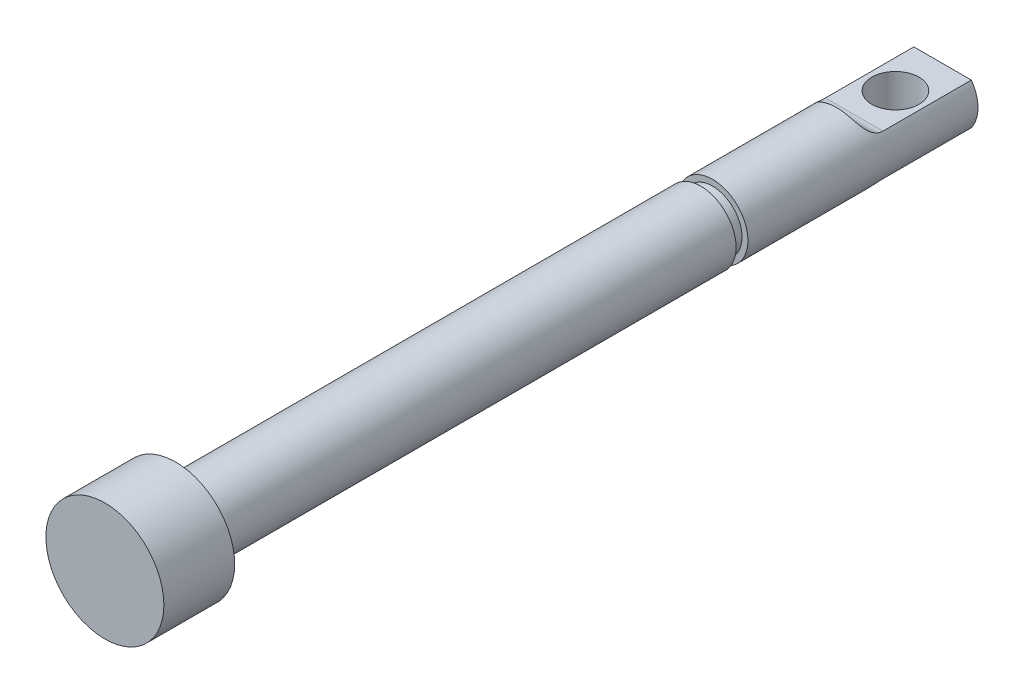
ISO-10303-21;
HEADER;
FILE_DESCRIPTION(('STEP AP214'),'2;1');
FILE_NAME('part.step','',(''),(''),'','','');
FILE_SCHEMA(('AUTOMOTIVE_DESIGN { 1 0 10303 214 1 1 1 1 }'));
ENDSEC;
DATA;
#1=APPLICATION_CONTEXT('core data for automotive mechanical design processes');
#2=APPLICATION_PROTOCOL_DEFINITION('international standard','automotive_design',2000,#1);
#3=PRODUCT_CONTEXT('',#1,'mechanical');
#4=PRODUCT('Part','Part','',(#3));
#5=PRODUCT_RELATED_PRODUCT_CATEGORY('part','',(#4));
#6=PRODUCT_DEFINITION_FORMATION('','',#4);
#7=PRODUCT_DEFINITION_CONTEXT('part definition',#1,'design');
#8=PRODUCT_DEFINITION('design','',#6,#7);
#9=PRODUCT_DEFINITION_SHAPE('','',#8);
#10=(LENGTH_UNIT() NAMED_UNIT(*) SI_UNIT(.MILLI.,.METRE.));
#11=(NAMED_UNIT(*) PLANE_ANGLE_UNIT() SI_UNIT($,.RADIAN.));
#12=(NAMED_UNIT(*) SI_UNIT($,.STERADIAN.) SOLID_ANGLE_UNIT());
#13=UNCERTAINTY_MEASURE_WITH_UNIT(LENGTH_MEASURE(1.E-05),#10,'distance_accuracy_value','');
#14=(GEOMETRIC_REPRESENTATION_CONTEXT(3) GLOBAL_UNCERTAINTY_ASSIGNED_CONTEXT((#13)) GLOBAL_UNIT_ASSIGNED_CONTEXT((#10,
#11,#12)) REPRESENTATION_CONTEXT('',''));
#15=CARTESIAN_POINT('',(0.,0.,0.));
#16=DIRECTION('',(0.,0.,1.));
#17=DIRECTION('',(1.,0.,0.));
#18=AXIS2_PLACEMENT_3D('',#15,#16,#17);
#19=CARTESIAN_POINT('',(0.,0.,65.));
#20=DIRECTION('',(0.,0.,-1.));
#21=DIRECTION('',(-1.,0.,0.));
#22=AXIS2_PLACEMENT_3D('',#19,#20,#21);
#23=CYLINDRICAL_SURFACE('',#22,6.);
#24=CARTESIAN_POINT('',(0.,0.,-23.9999999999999));
#25=DIRECTION('',(0.,0.,1.));
#26=DIRECTION('',(1.,0.,0.));
#27=AXIS2_PLACEMENT_3D('',#24,#25,#26);
#28=CIRCLE('',#27,6.);
#29=CARTESIAN_POINT('',(5.99999999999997,0.,-23.9999999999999));
#30=VERTEX_POINT('',#29);
#31=EDGE_CURVE('E139',#30,#30,#28,.T.);
#32=ORIENTED_EDGE('',*,*,#31,.T.);
#33=EDGE_LOOP('',(#32));
#34=FACE_BOUND('',#33,.T.);
#35=CARTESIAN_POINT('',(0.,0.,65.));
#36=DIRECTION('',(0.,0.,1.));
#37=DIRECTION('',(1.,0.,0.));
#38=AXIS2_PLACEMENT_3D('',#35,#36,#37);
#39=CIRCLE('',#38,6.);
#40=CARTESIAN_POINT('',(6.,0.,65.));
#41=VERTEX_POINT('',#40);
#42=EDGE_CURVE('E121',#41,#41,#39,.T.);
#43=ORIENTED_EDGE('',*,*,#42,.F.);
#44=EDGE_LOOP('',(#43));
#45=FACE_BOUND('',#44,.T.);
#46=ADVANCED_FACE('F40',(#34,#45),#23,.T.);
#47=CARTESIAN_POINT('',(0.,0.,65.));
#48=DIRECTION('',(0.,0.,1.));
#49=DIRECTION('',(1.,0.,0.));
#50=AXIS2_PLACEMENT_3D('',#47,#48,#49);
#51=PLANE('',#50);
#52=CARTESIAN_POINT('',(0.,0.,65.));
#53=DIRECTION('',(0.,0.,1.));
#54=DIRECTION('',(1.,0.,0.));
#55=AXIS2_PLACEMENT_3D('',#52,#53,#54);
#56=CIRCLE('',#55,10.);
#57=CARTESIAN_POINT('',(10.,0.,65.));
#58=VERTEX_POINT('',#57);
#59=EDGE_CURVE('E145',#58,#58,#56,.T.);
#60=ORIENTED_EDGE('',*,*,#59,.F.);
#61=EDGE_LOOP('',(#60));
#62=FACE_BOUND('',#61,.T.);
#63=ORIENTED_EDGE('',*,*,#42,.T.);
#64=EDGE_LOOP('',(#63));
#65=FACE_BOUND('',#64,.T.);
#66=ADVANCED_FACE('F165',(#62,#65),#51,.F.);
#67=CARTESIAN_POINT('',(0.,-2.04003480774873E-12,77.));
#68=DIRECTION('',(0.,0.,-1.));
#69=DIRECTION('',(-1.,0.,0.));
#70=AXIS2_PLACEMENT_3D('',#67,#68,#69);
#71=CYLINDRICAL_SURFACE('',#70,10.);
#72=CARTESIAN_POINT('',(0.,-2.04003480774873E-12,77.));
#73=DIRECTION('',(0.,0.,1.));
#74=DIRECTION('',(1.,0.,0.));
#75=AXIS2_PLACEMENT_3D('',#72,#73,#74);
#76=CIRCLE('',#75,10.);
#77=CARTESIAN_POINT('',(10.,-2.04003480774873E-12,77.));
#78=VERTEX_POINT('',#77);
#79=EDGE_CURVE('E136',#78,#78,#76,.T.);
#80=ORIENTED_EDGE('',*,*,#79,.F.);
#81=EDGE_LOOP('',(#80));
#82=FACE_BOUND('',#81,.T.);
#83=ORIENTED_EDGE('',*,*,#59,.T.);
#84=EDGE_LOOP('',(#83));
#85=FACE_BOUND('',#84,.T.);
#86=ADVANCED_FACE('F163',(#82,#85),#71,.T.);
#87=CARTESIAN_POINT('',(0.,-2.04003480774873E-12,77.));
#88=DIRECTION('',(0.,0.,1.));
#89=DIRECTION('',(1.,0.,0.));
#90=AXIS2_PLACEMENT_3D('',#87,#88,#89);
#91=PLANE('',#90);
#92=ORIENTED_EDGE('',*,*,#79,.T.);
#93=EDGE_LOOP('',(#92));
#94=FACE_BOUND('',#93,.T.);
#95=ADVANCED_FACE('F161',(#94),#91,.T.);
#96=CARTESIAN_POINT('',(0.,8.2981060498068,-26.));
#97=DIRECTION('',(0.,0.,-1.));
#98=DIRECTION('',(-1.,0.,0.));
#99=AXIS2_PLACEMENT_3D('',#96,#97,#98);
#100=PLANE('',#99);
#101=CARTESIAN_POINT('',(0.,0.,-26.));
#102=DIRECTION('',(0.,0.,-1.));
#103=DIRECTION('',(-1.,0.,0.));
#104=AXIS2_PLACEMENT_3D('',#101,#102,#103);
#105=CIRCLE('',#104,5.);
#106=CARTESIAN_POINT('',(-5.,0.,-26.));
#107=VERTEX_POINT('',#106);
#108=EDGE_CURVE('E141',#107,#107,#105,.T.);
#109=ORIENTED_EDGE('',*,*,#108,.T.);
#110=EDGE_LOOP('',(#109));
#111=FACE_BOUND('',#110,.T.);
#112=CARTESIAN_POINT('',(0.,0.,-26.));
#113=DIRECTION('',(0.,0.,-1.));
#114=DIRECTION('',(-1.,0.,0.));
#115=AXIS2_PLACEMENT_3D('',#112,#113,#114);
#116=CIRCLE('',#115,6.);
#117=CARTESIAN_POINT('',(-6.,0.,-26.));
#118=VERTEX_POINT('',#117);
#119=EDGE_CURVE('E122',#118,#118,#116,.T.);
#120=ORIENTED_EDGE('',*,*,#119,.F.);
#121=EDGE_LOOP('',(#120));
#122=FACE_BOUND('',#121,.T.);
#123=ADVANCED_FACE('F171',(#111,#122),#100,.F.);
#124=CARTESIAN_POINT('',(0.,8.2981060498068,-24.));
#125=DIRECTION('',(0.,0.,1.));
#126=DIRECTION('',(1.,0.,0.));
#127=AXIS2_PLACEMENT_3D('',#124,#125,#126);
#128=PLANE('',#127);
#129=CARTESIAN_POINT('',(0.,0.,-23.9999999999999));
#130=DIRECTION('',(0.,0.,-1.));
#131=DIRECTION('',(-1.,0.,0.));
#132=AXIS2_PLACEMENT_3D('',#129,#130,#131);
#133=CIRCLE('',#132,5.);
#134=CARTESIAN_POINT('',(-5.00000000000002,0.,-23.9999999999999));
#135=VERTEX_POINT('',#134);
#136=EDGE_CURVE('E147',#135,#135,#133,.T.);
#137=ORIENTED_EDGE('',*,*,#136,.F.);
#138=EDGE_LOOP('',(#137));
#139=FACE_BOUND('',#138,.T.);
#140=ORIENTED_EDGE('',*,*,#31,.F.);
#141=EDGE_LOOP('',(#140));
#142=FACE_BOUND('',#141,.T.);
#143=ADVANCED_FACE('F111',(#139,#142),#128,.F.);
#144=CARTESIAN_POINT('',(0.,-2.04003480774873E-12,-45.4208729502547));
#145=DIRECTION('',(0.,0.,-1.));
#146=DIRECTION('',(-1.,0.,0.));
#147=AXIS2_PLACEMENT_3D('',#144,#145,#146);
#148=CYLINDRICAL_SURFACE('',#147,5.);
#149=ORIENTED_EDGE('',*,*,#108,.F.);
#150=EDGE_LOOP('',(#149));
#151=FACE_BOUND('',#150,.T.);
#152=ORIENTED_EDGE('',*,*,#136,.T.);
#153=EDGE_LOOP('',(#152));
#154=FACE_BOUND('',#153,.T.);
#155=ADVANCED_FACE('F193',(#151,#154),#148,.T.);
#156=CARTESIAN_POINT('',(0.,-6.00000000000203,-56.9999999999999));
#157=DIRECTION('',(0.,1.,0.));
#158=DIRECTION('',(0.,0.,1.));
#159=AXIS2_PLACEMENT_3D('',#156,#157,#158);
#160=CYLINDRICAL_SURFACE('',#159,4.00000000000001);
#161=CARTESIAN_POINT('',(0.,-3.50000000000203,-56.9999999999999));
#162=DIRECTION('',(0.,1.,0.));
#163=DIRECTION('',(0.,0.,1.));
#164=AXIS2_PLACEMENT_3D('',#161,#162,#163);
#165=CIRCLE('',#164,4.00000000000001);
#166=CARTESIAN_POINT('',(0.,-3.50000000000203,-52.9999999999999));
#167=VERTEX_POINT('',#166);
#168=EDGE_CURVE('E209',#167,#167,#165,.F.);
#169=CARTESIAN_POINT('',(0.,3.49999999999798,-56.9999999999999));
#170=DIRECTION('',(0.,-1.,0.));
#171=DIRECTION('',(0.,0.,-1.));
#172=AXIS2_PLACEMENT_3D('',#169,#170,#171);
#173=CIRCLE('',#172,4.00000000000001);
#174=CARTESIAN_POINT('',(0.,3.49999999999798,-52.9999999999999));
#175=VERTEX_POINT('',#174);
#176=EDGE_CURVE('E152',#175,#175,#173,.F.);
#177=CARTESIAN_POINT('',(0.,-3.50000000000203,-52.9999999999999));
#178=CARTESIAN_POINT('',(0.,-3.42708333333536,-52.9999999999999));
#179=CARTESIAN_POINT('',(0.,-3.3541666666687,-52.9999999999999));
#180=CARTESIAN_POINT('',(0.,-3.20833333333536,-52.9999999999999));
#181=CARTESIAN_POINT('',(0.,-3.1354166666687,-52.9999999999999));
#182=CARTESIAN_POINT('',(0.,-2.98958333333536,-52.9999999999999));
#183=CARTESIAN_POINT('',(0.,-2.9166666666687,-52.9999999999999));
#184=CARTESIAN_POINT('',(0.,-2.77083333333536,-52.9999999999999));
#185=CARTESIAN_POINT('',(0.,-2.6979166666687,-52.9999999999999));
#186=CARTESIAN_POINT('',(0.,-2.55208333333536,-52.9999999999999));
#187=CARTESIAN_POINT('',(0.,-2.4791666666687,-52.9999999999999));
#188=CARTESIAN_POINT('',(0.,-2.33333333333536,-52.9999999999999));
#189=CARTESIAN_POINT('',(0.,-2.2604166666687,-52.9999999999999));
#190=CARTESIAN_POINT('',(0.,-2.11458333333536,-52.9999999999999));
#191=CARTESIAN_POINT('',(0.,-2.0416666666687,-52.9999999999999));
#192=CARTESIAN_POINT('',(0.,-1.89583333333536,-52.9999999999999));
#193=CARTESIAN_POINT('',(0.,-1.8229166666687,-52.9999999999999));
#194=CARTESIAN_POINT('',(0.,-1.67708333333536,-52.9999999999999));
#195=CARTESIAN_POINT('',(0.,-1.6041666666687,-52.9999999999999));
#196=CARTESIAN_POINT('',(0.,-1.45833333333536,-52.9999999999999));
#197=CARTESIAN_POINT('',(0.,-1.38541666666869,-52.9999999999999));
#198=CARTESIAN_POINT('',(0.,-1.23958333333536,-52.9999999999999));
#199=CARTESIAN_POINT('',(0.,-1.16666666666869,-52.9999999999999));
#200=CARTESIAN_POINT('',(0.,-1.02083333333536,-52.9999999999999));
#201=CARTESIAN_POINT('',(0.,-0.947916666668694,-52.9999999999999));
#202=CARTESIAN_POINT('',(0.,-0.802083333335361,-52.9999999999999));
#203=CARTESIAN_POINT('',(0.,-0.729166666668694,-52.9999999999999));
#204=CARTESIAN_POINT('',(0.,-0.583333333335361,-52.9999999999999));
#205=CARTESIAN_POINT('',(0.,-0.510416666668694,-52.9999999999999));
#206=CARTESIAN_POINT('',(0.,-0.364583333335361,-52.9999999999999));
#207=CARTESIAN_POINT('',(0.,-0.291666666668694,-52.9999999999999));
#208=CARTESIAN_POINT('',(0.,-0.14583333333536,-52.9999999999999));
#209=CARTESIAN_POINT('',(0.,-0.0729166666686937,-52.9999999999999));
#210=CARTESIAN_POINT('',(0.,0.0729166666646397,-52.9999999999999));
#211=CARTESIAN_POINT('',(0.,0.145833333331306,-52.9999999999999));
#212=CARTESIAN_POINT('',(0.,0.29166666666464,-52.9999999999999));
#213=CARTESIAN_POINT('',(0.,0.364583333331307,-52.9999999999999));
#214=CARTESIAN_POINT('',(0.,0.51041666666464,-52.9999999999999));
#215=CARTESIAN_POINT('',(0.,0.583333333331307,-52.9999999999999));
#216=CARTESIAN_POINT('',(0.,0.72916666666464,-52.9999999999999));
#217=CARTESIAN_POINT('',(0.,0.802083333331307,-52.9999999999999));
#218=CARTESIAN_POINT('',(0.,0.94791666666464,-52.9999999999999));
#219=CARTESIAN_POINT('',(0.,1.02083333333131,-52.9999999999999));
#220=CARTESIAN_POINT('',(0.,1.16666666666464,-52.9999999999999));
#221=CARTESIAN_POINT('',(0.,1.23958333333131,-52.9999999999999));
#222=CARTESIAN_POINT('',(0.,1.38541666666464,-52.9999999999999));
#223=CARTESIAN_POINT('',(0.,1.45833333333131,-52.9999999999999));
#224=CARTESIAN_POINT('',(0.,1.60416666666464,-52.9999999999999));
#225=CARTESIAN_POINT('',(0.,1.67708333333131,-52.9999999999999));
#226=CARTESIAN_POINT('',(0.,1.82291666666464,-52.9999999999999));
#227=CARTESIAN_POINT('',(0.,1.89583333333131,-52.9999999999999));
#228=CARTESIAN_POINT('',(0.,2.04166666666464,-52.9999999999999));
#229=CARTESIAN_POINT('',(0.,2.11458333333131,-52.9999999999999));
#230=CARTESIAN_POINT('',(0.,2.26041666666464,-52.9999999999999));
#231=CARTESIAN_POINT('',(0.,2.33333333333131,-52.9999999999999));
#232=CARTESIAN_POINT('',(0.,2.47916666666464,-52.9999999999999));
#233=CARTESIAN_POINT('',(0.,2.55208333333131,-52.9999999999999));
#234=CARTESIAN_POINT('',(0.,2.69791666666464,-52.9999999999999));
#235=CARTESIAN_POINT('',(0.,2.77083333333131,-52.9999999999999));
#236=CARTESIAN_POINT('',(0.,2.91666666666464,-52.9999999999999));
#237=CARTESIAN_POINT('',(0.,2.98958333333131,-52.9999999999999));
#238=CARTESIAN_POINT('',(0.,3.13541666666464,-52.9999999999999));
#239=CARTESIAN_POINT('',(0.,3.20833333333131,-52.9999999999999));
#240=CARTESIAN_POINT('',(0.,3.35416666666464,-52.9999999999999));
#241=CARTESIAN_POINT('',(0.,3.42708333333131,-52.9999999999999));
#242=CARTESIAN_POINT('',(0.,3.49999999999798,-52.9999999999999));
#243=B_SPLINE_CURVE_WITH_KNOTS('',3,(#177,#178,#179,#180,#181,#182,#183,#184,#185,#186,#187,
#188,#189,#190,#191,#192,#193,#194,#195,#196,#197,#198,#199,#200,#201,#202,#203,#204,#205,#206,
#207,#208,#209,#210,#211,#212,#213,#214,#215,#216,#217,#218,#219,#220,#221,#222,#223,#224,#225,
#226,#227,#228,#229,#230,#231,#232,#233,#234,#235,#236,#237,#238,#239,#240,#241,#242),
.UNSPECIFIED.,.F.,.F.,(4,2,2,2,2,2,2,2,2,2,2,2,2,2,2,2,2,2,2,2,2,2,2,2,2,2,2,2,2,2,2,2,4),(0.,
0.21875,0.4375,0.656250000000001,0.875000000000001,1.09375,1.3125,1.53125,1.75,1.96875,2.1875,
2.40625,2.625,2.84375,3.0625,3.28125,3.5,3.71875,3.9375,4.15625,4.375,4.59375,4.8125,5.03125,
5.25,5.46875,5.6875,5.90625,6.125,6.34375,6.56250000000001,6.78125000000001,7.00000000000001),.UNSPECIFIED.);
#244=EDGE_CURVE('BSEAM186',#167,#175,#243,.T.);
#245=ORIENTED_EDGE('',*,*,#168,.T.);
#246=ORIENTED_EDGE('',*,*,#176,.T.);
#247=ORIENTED_EDGE('',*,*,#244,.T.);
#248=ORIENTED_EDGE('',*,*,#244,.F.);
#249=EDGE_LOOP('',(#245,#247,#246,#248));
#250=FACE_BOUND('',#249,.T.);
#251=ADVANCED_FACE('F186',(#250),#160,.F.);
#252=CARTESIAN_POINT('',(0.,-2.04003480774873E-12,-65.));
#253=DIRECTION('',(0.,0.,1.));
#254=DIRECTION('',(1.,0.,0.));
#255=AXIS2_PLACEMENT_3D('',#252,#253,#254);
#256=PLANE('',#255);
#257=CARTESIAN_POINT('',(0.,-2.04003480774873E-12,-65.));
#258=DIRECTION('',(0.,0.,1.));
#259=DIRECTION('',(1.,0.,0.));
#260=AXIS2_PLACEMENT_3D('',#257,#258,#259);
#261=CIRCLE('',#260,6.);
#262=CARTESIAN_POINT('',(4.87339717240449,-3.50000000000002,-65.));
#263=VERTEX_POINT('',#262);
#264=CARTESIAN_POINT('',(4.87339717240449,3.49999999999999,-65.));
#265=VERTEX_POINT('',#264);
#266=EDGE_CURVE('E132',#263,#265,#261,.T.);
#267=ORIENTED_EDGE('',*,*,#266,.F.);
#268=DIRECTION('',(-1.,0.,0.));
#269=VECTOR('',#268,1.);
#270=CARTESIAN_POINT('',(0.,-3.50000000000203,-65.));
#271=LINE('',#270,#269);
#272=CARTESIAN_POINT('',(-4.87339717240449,-3.50000000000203,-65.0000000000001));
#273=VERTEX_POINT('',#272);
#274=EDGE_CURVE('E81',#263,#273,#271,.T.);
#275=ORIENTED_EDGE('',*,*,#274,.T.);
#276=CARTESIAN_POINT('',(-4.87339717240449,3.49999999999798,-65.0000000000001));
#277=VERTEX_POINT('',#276);
#278=EDGE_CURVE('E127',#277,#273,#261,.T.);
#279=ORIENTED_EDGE('',*,*,#278,.F.);
#280=DIRECTION('',(1.,0.,0.));
#281=VECTOR('',#280,1.);
#282=CARTESIAN_POINT('',(0.,3.49999999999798,-65.));
#283=LINE('',#282,#281);
#284=EDGE_CURVE('E131',#277,#265,#283,.T.);
#285=ORIENTED_EDGE('',*,*,#284,.T.);
#286=EDGE_LOOP('',(#267,#275,#279,#285));
#287=FACE_BOUND('',#286,.T.);
#288=ADVANCED_FACE('F130',(#287),#256,.F.);
#289=ORIENTED_EDGE('',*,*,#119,.T.);
#290=EDGE_LOOP('',(#289));
#291=FACE_BOUND('',#290,.T.);
#292=CARTESIAN_POINT('',(0.,-6.00000000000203,-47.0419601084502));
#293=CARTESIAN_POINT('',(0.164086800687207,-5.99999907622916,-47.0419572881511));
#294=CARTESIAN_POINT('',(0.328220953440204,-5.99326231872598,-47.0430745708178));
#295=CARTESIAN_POINT('',(0.655431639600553,-5.96635421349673,-47.0478136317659));
#296=CARTESIAN_POINT('',(0.8185074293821,-5.9461742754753,-47.0514370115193));
#297=CARTESIAN_POINT('',(1.14271710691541,-5.89247422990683,-47.0620306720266));
#298=CARTESIAN_POINT('',(1.30384593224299,-5.8589248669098,-47.069008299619));
#299=CARTESIAN_POINT('',(1.62250892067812,-5.77879171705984,-47.087689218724));
#300=CARTESIAN_POINT('',(1.78004448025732,-5.73221309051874,-47.0993906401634));
#301=CARTESIAN_POINT('',(2.05460033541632,-5.63866666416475,-47.1259983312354));
#302=CARTESIAN_POINT('',(2.17262271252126,-5.59424062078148,-47.139553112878));
#303=CARTESIAN_POINT('',(2.40504716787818,-5.49832168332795,-47.1717140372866));
#304=CARTESIAN_POINT('',(2.51944999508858,-5.44683026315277,-47.190319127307));
#305=CARTESIAN_POINT('',(2.74362615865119,-5.33741887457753,-47.2337999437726));
#306=CARTESIAN_POINT('',(2.85340849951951,-5.2795122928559,-47.2586627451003));
#307=CARTESIAN_POINT('',(3.06766075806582,-5.15796531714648,-47.316074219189));
#308=CARTESIAN_POINT('',(3.17213247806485,-5.09432688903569,-47.3486202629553));
#309=CARTESIAN_POINT('',(3.34743824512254,-4.98020773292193,-47.4128617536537));
#310=CARTESIAN_POINT('',(3.41975480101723,-4.93079844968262,-47.4424262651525));
#311=CARTESIAN_POINT('',(3.56054572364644,-4.83011362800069,-47.5069985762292));
#312=CARTESIAN_POINT('',(3.6290211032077,-4.77883858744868,-47.542004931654));
#313=CARTESIAN_POINT('',(3.76162234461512,-4.67517587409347,-47.6179551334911));
#314=CARTESIAN_POINT('',(3.82575173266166,-4.62278914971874,-47.6588940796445));
#315=CARTESIAN_POINT('',(3.94922469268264,-4.51776562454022,-47.7471226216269));
#316=CARTESIAN_POINT('',(4.00856904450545,-4.46512886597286,-47.7944111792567));
#317=CARTESIAN_POINT('',(4.15998999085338,-4.32561848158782,-47.9295478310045));
#318=CARTESIAN_POINT('',(4.24744810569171,-4.23936454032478,-48.0233870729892));
#319=CARTESIAN_POINT('',(4.40595587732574,-4.07439510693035,-48.2297273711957));
#320=CARTESIAN_POINT('',(4.47701025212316,-3.99567745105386,-48.3422230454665));
#321=CARTESIAN_POINT('',(4.60202217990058,-3.85105248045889,-48.5846990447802));
#322=CARTESIAN_POINT('',(4.65589850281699,-3.78520658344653,-48.7147584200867));
#323=CARTESIAN_POINT('',(4.74583258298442,-3.67183388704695,-48.9883742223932));
#324=CARTESIAN_POINT('',(4.78189220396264,-3.62430517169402,-49.1319292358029));
#325=CARTESIAN_POINT('',(4.83410438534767,-3.55431760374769,-49.4148899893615));
#326=CARTESIAN_POINT('',(4.8517059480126,-3.53004971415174,-49.553585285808));
#327=CARTESIAN_POINT('',(4.87251123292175,-3.50128019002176,-49.8340608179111));
#328=CARTESIAN_POINT('',(4.87571834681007,-3.49677389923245,-49.9758403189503));
#329=CARTESIAN_POINT('',(4.86790760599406,-3.50763570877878,-50.2541843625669));
#330=CARTESIAN_POINT('',(4.85729106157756,-3.52244313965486,-50.3907826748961));
#331=CARTESIAN_POINT('',(4.82236829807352,-3.57010187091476,-50.6589675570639));
#332=CARTESIAN_POINT('',(4.79806394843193,-3.6029507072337,-50.7905548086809));
#333=CARTESIAN_POINT('',(4.73546689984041,-3.68483287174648,-51.0453601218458));
#334=CARTESIAN_POINT('',(4.69714708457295,-3.73389755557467,-51.1685614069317));
#335=CARTESIAN_POINT('',(4.60644904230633,-3.84522502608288,-51.4032255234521));
#336=CARTESIAN_POINT('',(4.55407078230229,-3.90748784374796,-51.5146883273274));
#337=CARTESIAN_POINT('',(4.43364592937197,-4.04367278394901,-51.7271071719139));
#338=CARTESIAN_POINT('',(4.36514332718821,-4.11790937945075,-51.8276009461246));
#339=CARTESIAN_POINT('',(4.21439546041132,-4.27205571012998,-52.0126566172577));
#340=CARTESIAN_POINT('',(4.13214530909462,-4.35196745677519,-52.0972128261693));
#341=CARTESIAN_POINT('',(3.98430865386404,-4.48684830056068,-52.2255000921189));
#342=CARTESIAN_POINT('',(3.92204340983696,-4.54144689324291,-52.2735490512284));
#343=CARTESIAN_POINT('',(3.79244962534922,-4.65021221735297,-52.3628870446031));
#344=CARTESIAN_POINT('',(3.72511967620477,-4.70437882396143,-52.4041741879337));
#345=CARTESIAN_POINT('',(3.58584746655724,-4.81138491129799,-52.4805057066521));
#346=CARTESIAN_POINT('',(3.51389841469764,-4.86422227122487,-52.5155405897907));
#347=CARTESIAN_POINT('',(3.36598404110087,-4.96772653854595,-52.5798938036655));
#348=CARTESIAN_POINT('',(3.29001762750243,-5.01839284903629,-52.6092105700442));
#349=CARTESIAN_POINT('',(3.10628277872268,-5.1348555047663,-52.6724960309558));
#350=CARTESIAN_POINT('',(2.99699695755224,-5.19945229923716,-52.7042784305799));
#351=CARTESIAN_POINT('',(2.77298874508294,-5.32229969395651,-52.7599952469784));
#352=CARTESIAN_POINT('',(2.65826432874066,-5.38054790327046,-52.7839267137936));
#353=CARTESIAN_POINT('',(2.42426297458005,-5.48995881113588,-52.8254634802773));
#354=CARTESIAN_POINT('',(2.30498188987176,-5.54111484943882,-52.8430628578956));
#355=CARTESIAN_POINT('',(2.0628234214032,-5.6357486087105,-52.8732447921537));
#356=CARTESIAN_POINT('',(1.93994633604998,-5.67922696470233,-52.88582776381));
#357=CARTESIAN_POINT('',(1.68739143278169,-5.75941096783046,-52.9074571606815));
#358=CARTESIAN_POINT('',(1.55762141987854,-5.79585910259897,-52.9163792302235));
#359=CARTESIAN_POINT('',(1.29576034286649,-5.85996401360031,-52.93111497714));
#360=CARTESIAN_POINT('',(1.16366924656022,-5.8876206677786,-52.93692861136));
#361=CARTESIAN_POINT('',(0.897864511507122,-5.93397307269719,-52.9462132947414));
#362=CARTESIAN_POINT('',(0.764151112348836,-5.95267013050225,-52.9496846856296));
#363=CARTESIAN_POINT('',(0.495730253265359,-5.98100905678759,-52.9548017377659));
#364=CARTESIAN_POINT('',(0.361022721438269,-5.99065026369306,-52.9564472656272));
#365=CARTESIAN_POINT('',(0.0637739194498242,-6.00185992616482,-52.9583620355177));
#366=CARTESIAN_POINT('',(-0.0988506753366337,-6.0013852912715,-52.9582828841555));
#367=CARTESIAN_POINT('',(-0.423531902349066,-5.9872391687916,-52.9558628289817));
#368=CARTESIAN_POINT('',(-0.58558842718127,-5.973565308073,-52.9535215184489));
#369=CARTESIAN_POINT('',(-0.908093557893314,-5.9331098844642,-52.9460243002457));
#370=CARTESIAN_POINT('',(-1.06854114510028,-5.90632049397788,-52.940866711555));
#371=CARTESIAN_POINT('',(-1.38655156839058,-5.83984993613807,-52.9266635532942));
#372=CARTESIAN_POINT('',(-1.54411502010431,-5.80017155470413,-52.9176188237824));
#373=CARTESIAN_POINT('',(-1.8271270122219,-5.71658040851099,-52.8961623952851));
#374=CARTESIAN_POINT('',(-1.95325138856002,-5.67471525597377,-52.8846497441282));
#375=CARTESIAN_POINT('',(-2.20199777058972,-5.58290014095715,-52.8567870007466));
#376=CARTESIAN_POINT('',(-2.32461973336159,-5.53295007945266,-52.8404368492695));
#377=CARTESIAN_POINT('',(-2.56529700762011,-5.42554955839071,-52.8015731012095));
#378=CARTESIAN_POINT('',(-2.68335946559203,-5.3681115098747,-52.7790696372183));
#379=CARTESIAN_POINT('',(-2.91412104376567,-5.24641683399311,-52.7263390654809));
#380=CARTESIAN_POINT('',(-3.02682210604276,-5.18216270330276,-52.6961147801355));
#381=CARTESIAN_POINT('',(-3.2146774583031,-5.06698349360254,-52.6361706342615));
#382=CARTESIAN_POINT('',(-3.29141687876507,-5.01744505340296,-52.6087378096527));
#383=CARTESIAN_POINT('',(-3.44108580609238,-4.91600387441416,-52.5484188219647));
#384=CARTESIAN_POINT('',(-3.51401629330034,-4.8641017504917,-52.5155340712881));
#385=CARTESIAN_POINT('',(-3.65550875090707,-4.75867906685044,-52.4437391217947));
#386=CARTESIAN_POINT('',(-3.72407512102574,-4.70516021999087,-52.4048351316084));
#387=CARTESIAN_POINT('',(-3.85637558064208,-4.59735380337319,-52.320479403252));
#388=CARTESIAN_POINT('',(-3.92011052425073,-4.54306637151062,-52.2750288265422));
#389=CARTESIAN_POINT('',(-4.08185025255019,-4.39960407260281,-52.1454120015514));
#390=CARTESIAN_POINT('',(-4.17532337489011,-4.31060001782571,-52.0552328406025));
#391=CARTESIAN_POINT('',(-4.34570993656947,-4.13877814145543,-51.8552455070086));
#392=CARTESIAN_POINT('',(-4.42262845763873,-4.05595842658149,-51.7454433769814));
#393=CARTESIAN_POINT('',(-4.52474385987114,-3.94073268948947,-51.5669219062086));
#394=CARTESIAN_POINT('',(-4.55665465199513,-3.90371818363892,-51.5048849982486));
#395=CARTESIAN_POINT('',(-4.61588700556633,-3.83349575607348,-51.3766220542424));
#396=CARTESIAN_POINT('',(-4.64321054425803,-3.80028619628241,-51.3103978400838));
#397=CARTESIAN_POINT('',(-4.69324042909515,-3.73832662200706,-51.1742047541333));
#398=CARTESIAN_POINT('',(-4.71594604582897,-3.70957731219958,-51.1042352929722));
#399=CARTESIAN_POINT('',(-4.7567419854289,-3.65711675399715,-50.9611615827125));
#400=CARTESIAN_POINT('',(-4.77483272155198,-3.63340505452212,-50.8880576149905));
#401=CARTESIAN_POINT('',(-4.81916134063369,-3.57463010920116,-50.6794078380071));
#402=CARTESIAN_POINT('',(-4.84025437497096,-3.54576913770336,-50.5409170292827));
#403=CARTESIAN_POINT('',(-4.86775935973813,-3.50791566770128,-50.2599172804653));
#404=CARTESIAN_POINT('',(-4.87417502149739,-3.498918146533,-50.1174093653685));
#405=CARTESIAN_POINT('',(-4.87249942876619,-3.50124883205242,-49.8375566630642));
#406=CARTESIAN_POINT('',(-4.86490005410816,-3.51188787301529,-49.7002030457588));
#407=CARTESIAN_POINT('',(-4.83602687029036,-3.55154025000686,-49.4296737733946));
#408=CARTESIAN_POINT('',(-4.814755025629,-3.58055094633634,-49.296497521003));
#409=CARTESIAN_POINT('',(-4.75831398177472,-3.65521783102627,-49.0380780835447));
#410=CARTESIAN_POINT('',(-4.72315159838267,-3.7008658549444,-48.9128310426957));
#411=CARTESIAN_POINT('',(-4.63879646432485,-3.80605951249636,-48.6734309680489));
#412=CARTESIAN_POINT('',(-4.58960405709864,-3.86560480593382,-48.5592776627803));
#413=CARTESIAN_POINT('',(-4.47583951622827,-3.99682082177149,-48.3414737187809));
#414=CARTESIAN_POINT('',(-4.41087792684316,-4.06878255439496,-48.2382031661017));
#415=CARTESIAN_POINT('',(-4.26715342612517,-4.2192673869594,-48.0472946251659));
#416=CARTESIAN_POINT('',(-4.18838660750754,-4.29779234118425,-47.959661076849));
#417=CARTESIAN_POINT('',(-4.01047195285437,-4.46456069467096,-47.7926972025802));
#418=CARTESIAN_POINT('',(-3.91011031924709,-4.55302907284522,-47.7148953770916));
#419=CARTESIAN_POINT('',(-3.69660190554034,-4.72802308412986,-47.5766625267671));
#420=CARTESIAN_POINT('',(-3.58344850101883,-4.81454768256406,-47.516240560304));
#421=CARTESIAN_POINT('',(-3.37256558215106,-4.96373686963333,-47.4220385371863));
#422=CARTESIAN_POINT('',(-3.27687329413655,-5.0274818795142,-47.385321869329));
#423=CARTESIAN_POINT('',(-3.07998815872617,-5.15045074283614,-47.3197809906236));
#424=CARTESIAN_POINT('',(-2.97879283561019,-5.20967253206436,-47.2909603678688));
#425=CARTESIAN_POINT('',(-2.7715482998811,-5.3228284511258,-47.2399036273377));
#426=CARTESIAN_POINT('',(-2.66548692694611,-5.37674814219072,-47.2176851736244));
#427=CARTESIAN_POINT('',(-2.44950622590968,-5.47851993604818,-47.1787333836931));
#428=CARTESIAN_POINT('',(-2.3395859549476,-5.52637054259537,-47.1620013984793));
#429=CARTESIAN_POINT('',(-2.08241207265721,-5.62922357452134,-47.1284995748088));
#430=CARTESIAN_POINT('',(-1.934033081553,-5.68192938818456,-47.1132869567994));
#431=CARTESIAN_POINT('',(-1.63313291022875,-5.77561514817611,-47.0883657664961));
#432=CARTESIAN_POINT('',(-1.48061005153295,-5.81659026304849,-47.0786594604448));
#433=CARTESIAN_POINT('',(-1.17295491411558,-5.88634069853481,-47.0632169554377));
#434=CARTESIAN_POINT('',(-1.01782882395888,-5.91514159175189,-47.0574724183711));
#435=CARTESIAN_POINT('',(-0.705789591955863,-5.96042742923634,-47.0488313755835));
#436=CARTESIAN_POINT('',(-0.54887757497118,-5.97691973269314,-47.0459331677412));
#437=CARTESIAN_POINT('',(-0.326414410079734,-5.99147089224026,-47.0434123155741));
#438=CARTESIAN_POINT('',(-0.261175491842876,-5.99466867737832,-47.0428653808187));
#439=CARTESIAN_POINT('',(-0.130626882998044,-5.99893340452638,-47.0421398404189));
#440=CARTESIAN_POINT('',(-0.0653171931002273,-6.00000036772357,-47.0419612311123));
#441=CARTESIAN_POINT('',(0.,-6.00000000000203,-47.0419601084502));
#442=B_SPLINE_CURVE_WITH_KNOTS('',3,(#292,#293,#294,#295,#296,#297,#298,#299,#300,#301,#302,
#303,#304,#305,#306,#307,#308,#309,#310,#311,#312,#313,#314,#315,#316,#317,#318,#319,#320,#321,
#322,#323,#324,#325,#326,#327,#328,#329,#330,#331,#332,#333,#334,#335,#336,#337,#338,#339,#340,
#341,#342,#343,#344,#345,#346,#347,#348,#349,#350,#351,#352,#353,#354,#355,#356,#357,#358,#359,
#360,#361,#362,#363,#364,#365,#366,#367,#368,#369,#370,#371,#372,#373,#374,#375,#376,#377,#378,
#379,#380,#381,#382,#383,#384,#385,#386,#387,#388,#389,#390,#391,#392,#393,#394,#395,#396,#397,
#398,#399,#400,#401,#402,#403,#404,#405,#406,#407,#408,#409,#410,#411,#412,#413,#414,#415,#416,
#417,#418,#419,#420,#421,#422,#423,#424,#425,#426,#427,#428,#429,#430,#431,#432,#433,#434,#435,
#436,#437,#438,#439,#440,#441),.UNSPECIFIED.,.T.,.F.,(4,2,2,2,2,2,2,2,2,2,2,2,2,2,2,2,2,2,2,2,2,
2,2,2,2,2,2,2,2,2,2,2,2,2,2,2,2,2,2,2,2,2,2,2,2,2,2,2,2,2,2,2,2,2,2,2,2,2,2,2,2,2,2,2,2,2,2,2,2,
2,2,2,2,2,4),(0.,0.492200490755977,0.984715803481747,1.47831482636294,1.97171863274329,
2.3519059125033,2.73201400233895,3.11134334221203,3.4905430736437,3.76763156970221,
4.04464665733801,4.32143422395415,4.59817658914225,5.05979916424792,5.52128880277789,
5.9849293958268,6.44852147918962,6.87211966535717,7.29561803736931,7.70709183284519,
8.11850944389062,8.53072728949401,8.94294610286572,9.36863310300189,9.79447174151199,
10.0813443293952,10.3682970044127,10.6556816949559,10.943144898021,11.3351627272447,
11.7273276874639,12.1198584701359,12.5123567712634,12.9172612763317,13.3221714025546,
13.7270224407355,14.1319030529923,14.6192113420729,15.1066072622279,15.5942944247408,
16.0818762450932,16.4816974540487,16.8815235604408,17.2806952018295,17.679721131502,
17.9656029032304,18.2514107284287,18.5369256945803,18.8223900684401,19.2926932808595,
19.7628519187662,19.9994905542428,20.2360269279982,20.4726006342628,20.7091531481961,
21.1359053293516,21.5625495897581,21.9745041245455,22.3863994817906,22.7980929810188,
23.2097764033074,23.6329019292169,24.0561474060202,24.5187264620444,24.9815461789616,
25.3431697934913,25.704957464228,26.0677045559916,26.4305409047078,26.9044793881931,
27.3786127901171,27.8517452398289,28.3245945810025,28.5205242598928,28.7164519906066),.UNSPECIFIED.);
#443=CARTESIAN_POINT('',(-4.87339717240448,-3.50000000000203,-50.));
#444=VERTEX_POINT('',#443);
#445=CARTESIAN_POINT('',(4.87339717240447,-3.50000000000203,-50.));
#446=VERTEX_POINT('',#445);
#447=EDGE_CURVE('E48',#444,#446,#442,.T.);
#448=ORIENTED_EDGE('',*,*,#447,.T.);
#449=DIRECTION('',(0.,0.,-1.));
#450=VECTOR('',#449,1.);
#451=CARTESIAN_POINT('',(4.87339717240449,-3.5,65.));
#452=LINE('',#451,#450);
#453=EDGE_CURVE('E13',#446,#263,#452,.T.);
#454=ORIENTED_EDGE('',*,*,#453,.T.);
#455=ORIENTED_EDGE('',*,*,#266,.T.);
#456=DIRECTION('',(0.,0.,-1.));
#457=VECTOR('',#456,1.);
#458=CARTESIAN_POINT('',(4.87339717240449,3.49999999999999,65.));
#459=LINE('',#458,#457);
#460=CARTESIAN_POINT('',(4.87339717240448,3.49999999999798,-50.));
#461=VERTEX_POINT('',#460);
#462=EDGE_CURVE('E120',#265,#461,#459,.F.);
#463=ORIENTED_EDGE('',*,*,#462,.T.);
#464=CARTESIAN_POINT('',(0.,5.99999999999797,-47.0419601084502));
#465=CARTESIAN_POINT('',(-0.164086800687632,5.99999907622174,-47.0419572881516));
#466=CARTESIAN_POINT('',(-0.328220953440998,5.99326231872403,-47.0430745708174));
#467=CARTESIAN_POINT('',(-0.655431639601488,5.96635421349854,-47.0478136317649));
#468=CARTESIAN_POINT('',(-0.818507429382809,5.94617427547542,-47.0514370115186));
#469=CARTESIAN_POINT('',(-1.14271710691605,5.89247422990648,-47.0620306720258));
#470=CARTESIAN_POINT('',(-1.30384593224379,5.85892486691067,-47.0690082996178));
#471=CARTESIAN_POINT('',(-1.62250892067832,5.77879171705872,-47.0876892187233));
#472=CARTESIAN_POINT('',(-1.78004448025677,5.73221309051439,-47.0993906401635));
#473=CARTESIAN_POINT('',(-2.0546003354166,5.63866666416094,-47.1259983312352));
#474=CARTESIAN_POINT('',(-2.17262271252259,5.59424062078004,-47.1395531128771));
#475=CARTESIAN_POINT('',(-2.40504716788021,5.49832168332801,-47.1717140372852));
#476=CARTESIAN_POINT('',(-2.51944999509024,5.44683026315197,-47.1903191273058));
#477=CARTESIAN_POINT('',(-2.743626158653,5.33741887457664,-47.2337999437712));
#478=CARTESIAN_POINT('',(-2.85340849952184,5.27951229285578,-47.2586627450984));
#479=CARTESIAN_POINT('',(-3.06766075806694,5.15796531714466,-47.3160742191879));
#480=CARTESIAN_POINT('',(-3.17213247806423,5.0943268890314,-47.3486202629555));
#481=CARTESIAN_POINT('',(-3.34743824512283,4.98020773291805,-47.4128617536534));
#482=CARTESIAN_POINT('',(-3.41975480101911,4.93079844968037,-47.4424262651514));
#483=CARTESIAN_POINT('',(-3.5605457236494,4.83011362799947,-47.5069985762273));
#484=CARTESIAN_POINT('',(-3.62902110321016,4.77883858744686,-47.5420049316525));
#485=CARTESIAN_POINT('',(-3.76162234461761,4.67517587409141,-47.6179551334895));
#486=CARTESIAN_POINT('',(-3.82575173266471,4.62278914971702,-47.6588940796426));
#487=CARTESIAN_POINT('',(-3.94922469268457,4.51776562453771,-47.7471226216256));
#488=CARTESIAN_POINT('',(-4.00856904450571,4.4651288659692,-47.7944111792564));
#489=CARTESIAN_POINT('',(-4.15998999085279,4.32561848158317,-47.929547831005));
#490=CARTESIAN_POINT('',(-4.24744810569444,4.23936454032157,-48.023387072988));
#491=CARTESIAN_POINT('',(-4.40595587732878,4.07439510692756,-48.2297273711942));
#492=CARTESIAN_POINT('',(-4.47701025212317,3.99567745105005,-48.3422230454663));
#493=CARTESIAN_POINT('',(-4.60202217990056,3.85105248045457,-48.5846990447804));
#494=CARTESIAN_POINT('',(-4.65589850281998,3.78520658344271,-48.7147584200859));
#495=CARTESIAN_POINT('',(-4.74583258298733,3.67183388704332,-48.9883742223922));
#496=CARTESIAN_POINT('',(-4.78189220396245,3.62430517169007,-49.1319292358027));
#497=CARTESIAN_POINT('',(-4.83410438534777,3.55431760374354,-49.4148899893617));
#498=CARTESIAN_POINT('',(-4.85170594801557,3.53004971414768,-49.5535852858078));
#499=CARTESIAN_POINT('',(-4.87251123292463,3.50128019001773,-49.8340608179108));
#500=CARTESIAN_POINT('',(-4.87571834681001,3.49677389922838,-49.9758403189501));
#501=CARTESIAN_POINT('',(-4.86790760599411,3.50763570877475,-50.2541843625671));
#502=CARTESIAN_POINT('',(-4.85729106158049,3.52244313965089,-50.3907826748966));
#503=CARTESIAN_POINT('',(-4.82236829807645,3.57010187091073,-50.6589675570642));
#504=CARTESIAN_POINT('',(-4.79806394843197,3.60295070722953,-50.7905548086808));
#505=CARTESIAN_POINT('',(-4.73546689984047,3.68483287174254,-51.045360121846));
#506=CARTESIAN_POINT('',(-4.69714708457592,3.73389755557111,-51.1685614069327));
#507=CARTESIAN_POINT('',(-4.60644904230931,3.84522502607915,-51.4032255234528));
#508=CARTESIAN_POINT('',(-4.55407078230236,3.90748784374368,-51.5146883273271));
#509=CARTESIAN_POINT('',(-4.43364592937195,4.04367278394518,-51.7271071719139));
#510=CARTESIAN_POINT('',(-4.36514332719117,4.11790937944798,-51.827600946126));
#511=CARTESIAN_POINT('',(-4.21439546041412,4.27205571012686,-52.012656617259));
#512=CARTESIAN_POINT('',(-4.13214530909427,4.35196745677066,-52.097212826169));
#513=CARTESIAN_POINT('',(-3.98430865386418,4.48684830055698,-52.2255000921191));
#514=CARTESIAN_POINT('',(-3.92204340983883,4.54144689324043,-52.2735490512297));
#515=CARTESIAN_POINT('',(-3.79244962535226,4.65021221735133,-52.3628870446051));
#516=CARTESIAN_POINT('',(-3.72511967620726,4.70437882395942,-52.4041741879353));
#517=CARTESIAN_POINT('',(-3.58584746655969,4.81138491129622,-52.4805057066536));
#518=CARTESIAN_POINT('',(-3.5138984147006,4.8642222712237,-52.5155405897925));
#519=CARTESIAN_POINT('',(-3.36598404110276,4.96772653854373,-52.5798938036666));
#520=CARTESIAN_POINT('',(-3.29001762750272,5.01839284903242,-52.6092105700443));
#521=CARTESIAN_POINT('',(-3.10628277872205,5.13485550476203,-52.6724960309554));
#522=CARTESIAN_POINT('',(-2.99699695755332,5.1994522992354,-52.7042784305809));
#523=CARTESIAN_POINT('',(-2.77298874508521,5.32229969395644,-52.7599952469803));
#524=CARTESIAN_POINT('',(-2.65826432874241,5.38054790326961,-52.783926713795));
#525=CARTESIAN_POINT('',(-2.4242629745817,5.48995881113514,-52.8254634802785));
#526=CARTESIAN_POINT('',(-2.30498188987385,5.54111484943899,-52.843062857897));
#527=CARTESIAN_POINT('',(-2.06282342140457,5.63574860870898,-52.8732447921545));
#528=CARTESIAN_POINT('',(-1.9399463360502,5.67922696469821,-52.88582776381));
#529=CARTESIAN_POINT('',(-1.68739143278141,5.75941096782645,-52.9074571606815));
#530=CARTESIAN_POINT('',(-1.55762141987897,5.79585910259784,-52.9163792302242));
#531=CARTESIAN_POINT('',(-1.29576034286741,5.85996401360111,-52.9311149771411));
#532=CARTESIAN_POINT('',(-1.16366924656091,5.88762066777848,-52.9369286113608));
#533=CARTESIAN_POINT('',(-0.897864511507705,5.93397307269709,-52.9462132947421));
#534=CARTESIAN_POINT('',(-0.764151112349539,5.95267013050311,-52.9496846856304));
#535=CARTESIAN_POINT('',(-0.495730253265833,5.98100905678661,-52.9548017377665));
#536=CARTESIAN_POINT('',(-0.361022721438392,5.99065026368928,-52.9564472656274));
#537=CARTESIAN_POINT('',(-0.0637739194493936,6.00185992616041,-52.9583620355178));
#538=CARTESIAN_POINT('',(0.0988506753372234,6.00138529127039,-52.9582828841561));
#539=CARTESIAN_POINT('',(0.423531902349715,5.98723916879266,-52.9558628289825));
#540=CARTESIAN_POINT('',(0.585588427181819,5.97356530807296,-52.9535215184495));
#541=CARTESIAN_POINT('',(0.908093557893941,5.9331098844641,-52.9460243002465));
#542=CARTESIAN_POINT('',(1.06854114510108,5.90632049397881,-52.940866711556));
#543=CARTESIAN_POINT('',(1.38655156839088,5.8398499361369,-52.9266635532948));
#544=CARTESIAN_POINT('',(1.54411502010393,5.80017155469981,-52.9176188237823));
#545=CARTESIAN_POINT('',(1.82712701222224,5.7165804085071,-52.8961623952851));
#546=CARTESIAN_POINT('',(1.9532513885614,5.67471525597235,-52.884649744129));
#547=CARTESIAN_POINT('',(2.20199777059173,5.58290014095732,-52.8567870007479));
#548=CARTESIAN_POINT('',(2.32461973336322,5.53295007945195,-52.8404368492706));
#549=CARTESIAN_POINT('',(2.56529700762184,5.42554955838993,-52.8015731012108));
#550=CARTESIAN_POINT('',(2.68335946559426,5.36811150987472,-52.7790696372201));
#551=CARTESIAN_POINT('',(2.91412104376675,5.24641683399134,-52.7263390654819));
#552=CARTESIAN_POINT('',(3.02682210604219,5.1821627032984,-52.6961147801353));
#553=CARTESIAN_POINT('',(3.21467745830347,5.06698349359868,-52.6361706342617));
#554=CARTESIAN_POINT('',(3.29141687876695,5.0174450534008,-52.6087378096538));
#555=CARTESIAN_POINT('',(3.44108580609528,4.91600387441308,-52.5484188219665));
#556=CARTESIAN_POINT('',(3.51401629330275,4.86410175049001,-52.5155340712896));
#557=CARTESIAN_POINT('',(3.65550875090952,4.75867906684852,-52.4437391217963));
#558=CARTESIAN_POINT('',(3.72407512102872,4.70516021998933,-52.4048351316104));
#559=CARTESIAN_POINT('',(3.85637558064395,4.59735380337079,-52.3204794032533));
#560=CARTESIAN_POINT('',(3.92011052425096,4.54306637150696,-52.2750288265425));
#561=CARTESIAN_POINT('',(4.08185025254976,4.39960407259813,-52.1454120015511));
#562=CARTESIAN_POINT('',(4.17532337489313,4.3106000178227,-52.0552328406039));
#563=CARTESIAN_POINT('',(4.34570993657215,4.13877814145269,-51.8552455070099));
#564=CARTESIAN_POINT('',(4.42262845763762,4.05595842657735,-51.7454433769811));
#565=CARTESIAN_POINT('',(4.52474385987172,3.94073268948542,-51.5669219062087));
#566=CARTESIAN_POINT('',(4.55665465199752,3.90371818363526,-51.5048849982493));
#567=CARTESIAN_POINT('',(4.61588700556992,3.83349575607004,-51.3766220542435));
#568=CARTESIAN_POINT('',(4.643210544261,3.80028619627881,-51.3103978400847));
#569=CARTESIAN_POINT('',(4.69324042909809,3.73832662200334,-51.1742047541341));
#570=CARTESIAN_POINT('',(4.71594604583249,3.70957731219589,-51.1042352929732));
#571=CARTESIAN_POINT('',(4.7567419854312,3.65711675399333,-50.9611615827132));
#572=CARTESIAN_POINT('',(4.77483272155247,3.63340505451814,-50.8880576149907));
#573=CARTESIAN_POINT('',(4.81916134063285,3.57463010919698,-50.6794078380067));
#574=CARTESIAN_POINT('',(4.84025437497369,3.5457691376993,-50.5409170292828));
#575=CARTESIAN_POINT('',(4.86775935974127,3.50791566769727,-50.2599172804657));
#576=CARTESIAN_POINT('',(4.87417502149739,3.49891814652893,-50.1174093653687));
#577=CARTESIAN_POINT('',(4.87249942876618,3.50124883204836,-49.837556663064));
#578=CARTESIAN_POINT('',(4.86490005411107,3.51188787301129,-49.7002030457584));
#579=CARTESIAN_POINT('',(4.8360268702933,3.55154025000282,-49.4296737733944));
#580=CARTESIAN_POINT('',(4.81475502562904,3.58055094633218,-49.2964975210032));
#581=CARTESIAN_POINT('',(4.75831398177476,3.65521783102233,-49.0380780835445));
#582=CARTESIAN_POINT('',(4.72315159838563,3.70086585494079,-48.9128310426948));
#583=CARTESIAN_POINT('',(4.63879646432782,3.80605951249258,-48.6734309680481));
#584=CARTESIAN_POINT('',(4.5896040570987,3.86560480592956,-48.5592776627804));
#585=CARTESIAN_POINT('',(4.47583951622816,3.99682082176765,-48.3414737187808));
#586=CARTESIAN_POINT('',(4.41087792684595,4.06878255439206,-48.2382031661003));
#587=CARTESIAN_POINT('',(4.26715342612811,4.21926738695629,-48.0472946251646));
#588=CARTESIAN_POINT('',(4.18838660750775,4.29779234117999,-47.959661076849));
#589=CARTESIAN_POINT('',(4.01047195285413,4.46456069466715,-47.7926972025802));
#590=CARTESIAN_POINT('',(3.9101103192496,4.55302907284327,-47.7148953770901));
#591=CARTESIAN_POINT('',(3.69660190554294,4.72802308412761,-47.5766625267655));
#592=CARTESIAN_POINT('',(3.58344850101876,4.81454768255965,-47.5162405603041));
#593=CARTESIAN_POINT('',(3.37256558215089,4.96373686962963,-47.4220385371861));
#594=CARTESIAN_POINT('',(3.2768732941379,5.02748187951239,-47.3853218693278));
#595=CARTESIAN_POINT('',(3.07998815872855,5.15045074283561,-47.3197809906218));
#596=CARTESIAN_POINT('',(2.97879283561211,5.20967253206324,-47.2909603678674));
#597=CARTESIAN_POINT('',(2.77154829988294,5.32282845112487,-47.2399036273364));
#598=CARTESIAN_POINT('',(2.66548692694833,5.37674814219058,-47.2176851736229));
#599=CARTESIAN_POINT('',(2.44950622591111,5.47851993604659,-47.1787333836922));
#600=CARTESIAN_POINT('',(2.33958595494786,5.52637054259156,-47.1620013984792));
#601=CARTESIAN_POINT('',(2.08241207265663,5.62922357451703,-47.1284995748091));
#602=CARTESIAN_POINT('',(1.93403308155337,5.68192938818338,-47.1132869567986));
#603=CARTESIAN_POINT('',(1.63313291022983,5.77561514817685,-47.0883657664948));
#604=CARTESIAN_POINT('',(1.4806100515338,5.81659026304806,-47.0786594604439));
#605=CARTESIAN_POINT('',(1.17295491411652,5.88634069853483,-47.0632169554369));
#606=CARTESIAN_POINT('',(1.01782882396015,5.91514159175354,-47.05747241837));
#607=CARTESIAN_POINT('',(0.705789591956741,5.96042742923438,-47.0488313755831));
#608=CARTESIAN_POINT('',(0.548877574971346,5.97691973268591,-47.0459331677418));
#609=CARTESIAN_POINT('',(0.326414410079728,5.9914708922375,-47.0434123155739));
#610=CARTESIAN_POINT('',(0.261175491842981,5.99466867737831,-47.042865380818));
#611=CARTESIAN_POINT('',(0.130626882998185,5.99893340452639,-47.0421398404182));
#612=CARTESIAN_POINT('',(0.0653171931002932,6.00000036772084,-47.041961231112));
#613=CARTESIAN_POINT('',(0.,5.99999999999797,-47.0419601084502));
#614=B_SPLINE_CURVE_WITH_KNOTS('',3,(#464,#465,#466,#467,#468,#469,#470,#471,#472,#473,#474,
#475,#476,#477,#478,#479,#480,#481,#482,#483,#484,#485,#486,#487,#488,#489,#490,#491,#492,#493,
#494,#495,#496,#497,#498,#499,#500,#501,#502,#503,#504,#505,#506,#507,#508,#509,#510,#511,#512,
#513,#514,#515,#516,#517,#518,#519,#520,#521,#522,#523,#524,#525,#526,#527,#528,#529,#530,#531,
#532,#533,#534,#535,#536,#537,#538,#539,#540,#541,#542,#543,#544,#545,#546,#547,#548,#549,#550,
#551,#552,#553,#554,#555,#556,#557,#558,#559,#560,#561,#562,#563,#564,#565,#566,#567,#568,#569,
#570,#571,#572,#573,#574,#575,#576,#577,#578,#579,#580,#581,#582,#583,#584,#585,#586,#587,#588,
#589,#590,#591,#592,#593,#594,#595,#596,#597,#598,#599,#600,#601,#602,#603,#604,#605,#606,#607,
#608,#609,#610,#611,#612,#613),.UNSPECIFIED.,.T.,.F.,(4,2,2,2,2,2,2,2,2,2,2,2,2,2,2,2,2,2,2,2,2,
2,2,2,2,2,2,2,2,2,2,2,2,2,2,2,2,2,2,2,2,2,2,2,2,2,2,2,2,2,2,2,2,2,2,2,2,2,2,2,2,2,2,2,2,2,2,2,2,
2,2,2,2,2,4),(0.,0.492200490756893,0.984715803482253,1.47831482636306,1.97171863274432,
2.35190591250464,2.73201400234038,3.11134334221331,3.49054307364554,3.76763156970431,
4.04464665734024,4.32143422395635,4.59817658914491,5.05979916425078,5.52128880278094,
5.98492939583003,6.44852147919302,6.87211966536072,7.29561803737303,7.70709183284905,
8.11850944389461,8.53072728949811,8.94294610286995,9.36863310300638,9.79447174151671,
10.0813443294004,10.3682970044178,10.6556816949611,10.9431448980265,11.3351627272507,
11.7273276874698,12.1198584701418,12.5123567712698,12.9172612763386,13.3221714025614,
13.7270224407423,14.1319030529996,14.6192113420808,15.1066072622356,15.5942944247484,
16.0818762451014,16.4816974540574,16.8815235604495,17.280695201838,17.6797211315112,
17.9656029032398,18.2514107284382,18.5369256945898,18.8223900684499,19.2926932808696,
19.7628519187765,19.9994905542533,20.2360269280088,20.4726006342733,20.709153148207,
21.1359053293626,21.5625495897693,21.9745041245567,22.386399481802,22.7980929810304,
23.2097764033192,23.6329019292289,24.0561474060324,24.5187264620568,24.9815461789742,
25.3431697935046,25.7049574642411,26.0677045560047,26.4305409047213,26.9044793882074,
27.3786127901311,27.8517452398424,28.3245945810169,28.5205242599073,28.7164519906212),.UNSPECIFIED.);
#615=CARTESIAN_POINT('',(-4.8733971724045,3.49999999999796,-50.));
#616=VERTEX_POINT('',#615);
#617=EDGE_CURVE('E114',#461,#616,#614,.T.);
#618=ORIENTED_EDGE('',*,*,#617,.T.);
#619=DIRECTION('',(0.,0.,-1.));
#620=VECTOR('',#619,1.);
#621=CARTESIAN_POINT('',(-4.87339717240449,3.49999999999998,65.));
#622=LINE('',#621,#620);
#623=EDGE_CURVE('E92',#616,#277,#622,.T.);
#624=ORIENTED_EDGE('',*,*,#623,.T.);
#625=ORIENTED_EDGE('',*,*,#278,.T.);
#626=DIRECTION('',(0.,0.,-1.));
#627=VECTOR('',#626,1.);
#628=CARTESIAN_POINT('',(-4.87339717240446,-3.5,65.));
#629=LINE('',#628,#627);
#630=EDGE_CURVE('E91',#273,#444,#629,.F.);
#631=ORIENTED_EDGE('',*,*,#630,.T.);
#632=EDGE_LOOP('',(#448,#454,#455,#463,#618,#624,#625,#631));
#633=FACE_BOUND('',#632,.T.);
#634=ADVANCED_FACE('F89',(#291,#633),#23,.T.);
#635=CARTESIAN_POINT('',(-10.,3.49999999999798,-72.2982915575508));
#636=DIRECTION('',(0.,-1.,0.));
#637=DIRECTION('',(0.,0.,-1.));
#638=AXIS2_PLACEMENT_3D('',#635,#636,#637);
#639=PLANE('',#638);
#640=DIRECTION('',(1.,0.,0.));
#641=VECTOR('',#640,1.);
#642=CARTESIAN_POINT('',(-9.99999999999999,3.49999999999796,-50.));
#643=LINE('',#642,#641);
#644=EDGE_CURVE('E62',#616,#461,#643,.T.);
#645=ORIENTED_EDGE('',*,*,#644,.T.);
#646=ORIENTED_EDGE('',*,*,#462,.F.);
#647=ORIENTED_EDGE('',*,*,#284,.F.);
#648=ORIENTED_EDGE('',*,*,#623,.F.);
#649=EDGE_LOOP('',(#645,#646,#647,#648));
#650=FACE_BOUND('',#649,.T.);
#651=ORIENTED_EDGE('',*,*,#176,.F.);
#652=EDGE_LOOP('',(#651));
#653=FACE_BOUND('',#652,.T.);
#654=ADVANCED_FACE('F104',(#650,#653),#639,.F.);
#655=CARTESIAN_POINT('',(-9.99999999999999,6.49999999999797,-50.));
#656=DIRECTION('',(1.,0.,0.));
#657=DIRECTION('',(0.,0.,-1.));
#658=AXIS2_PLACEMENT_3D('',#655,#656,#657);
#659=CYLINDRICAL_SURFACE('',#658,3.);
#660=ORIENTED_EDGE('',*,*,#644,.F.);
#661=ORIENTED_EDGE('',*,*,#617,.F.);
#662=EDGE_LOOP('',(#660,#661));
#663=FACE_BOUND('',#662,.T.);
#664=ADVANCED_FACE('F101',(#663),#659,.F.);
#665=CARTESIAN_POINT('',(-9.99999999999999,-6.50000000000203,-50.));
#666=DIRECTION('',(1.,0.,0.));
#667=DIRECTION('',(0.,0.,-1.));
#668=AXIS2_PLACEMENT_3D('',#665,#666,#667);
#669=CYLINDRICAL_SURFACE('',#668,3.);
#670=DIRECTION('',(1.,0.,0.));
#671=VECTOR('',#670,1.);
#672=CARTESIAN_POINT('',(-9.99999999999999,-3.50000000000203,-50.));
#673=LINE('',#672,#671);
#674=EDGE_CURVE('E55',#444,#446,#673,.T.);
#675=ORIENTED_EDGE('',*,*,#674,.T.);
#676=ORIENTED_EDGE('',*,*,#447,.F.);
#677=EDGE_LOOP('',(#675,#676));
#678=FACE_BOUND('',#677,.T.);
#679=ADVANCED_FACE('F86',(#678),#669,.F.);
#680=CARTESIAN_POINT('',(-9.99999999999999,-3.50000000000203,-50.));
#681=DIRECTION('',(0.,1.,0.));
#682=DIRECTION('',(0.,0.,1.));
#683=AXIS2_PLACEMENT_3D('',#680,#681,#682);
#684=PLANE('',#683);
#685=ORIENTED_EDGE('',*,*,#674,.F.);
#686=ORIENTED_EDGE('',*,*,#630,.F.);
#687=ORIENTED_EDGE('',*,*,#274,.F.);
#688=ORIENTED_EDGE('',*,*,#453,.F.);
#689=EDGE_LOOP('',(#685,#686,#687,#688));
#690=FACE_BOUND('',#689,.T.);
#691=ORIENTED_EDGE('',*,*,#168,.F.);
#692=EDGE_LOOP('',(#691));
#693=FACE_BOUND('',#692,.T.);
#694=ADVANCED_FACE('F78',(#690,#693),#684,.F.);
#695=CLOSED_SHELL('',(#46,#66,#86,#95,#123,#143,#155,#251,#288,#634,#654,#664,#679,#694));
#696=MANIFOLD_SOLID_BREP('B2',#695);
#697=ADVANCED_BREP_SHAPE_REPRESENTATION('',(#18,#696),#14);
#698=SHAPE_DEFINITION_REPRESENTATION(#9,#697);
ENDSEC;
END-ISO-10303-21;
